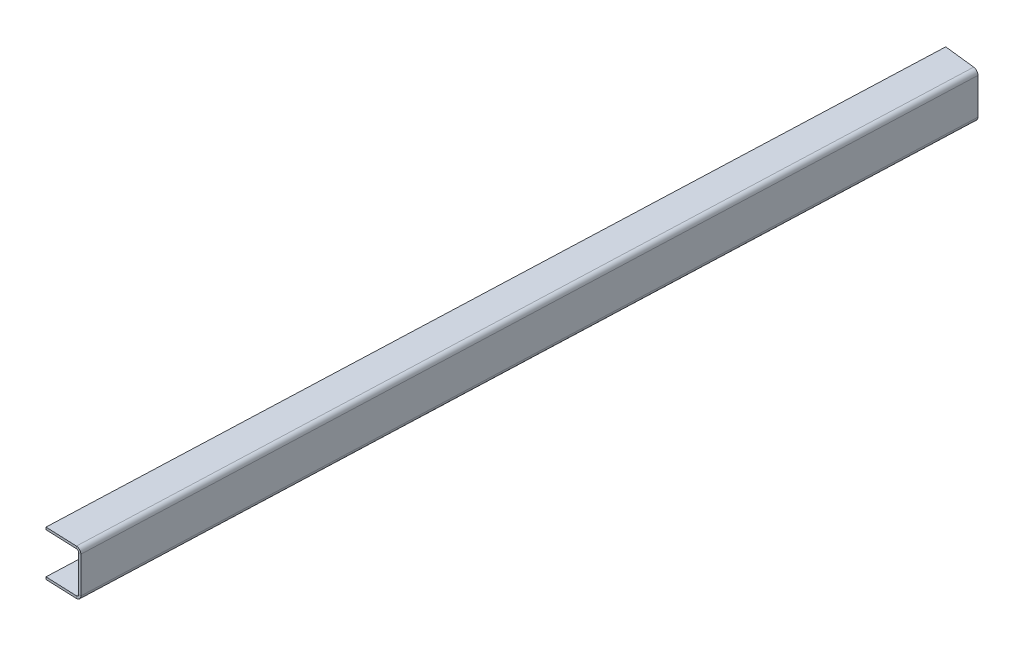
ISO-10303-21;
HEADER;
FILE_DESCRIPTION(('STEP AP214'),'2;1');
FILE_NAME('part.step','',(''),(''),'','','');
FILE_SCHEMA(('AUTOMOTIVE_DESIGN { 1 0 10303 214 1 1 1 1 }'));
ENDSEC;
DATA;
#1=APPLICATION_CONTEXT('core data for automotive mechanical design processes');
#2=APPLICATION_PROTOCOL_DEFINITION('international standard','automotive_design',2000,#1);
#3=PRODUCT_CONTEXT('',#1,'mechanical');
#4=PRODUCT('Part','Part','',(#3));
#5=PRODUCT_RELATED_PRODUCT_CATEGORY('part','',(#4));
#6=PRODUCT_DEFINITION_FORMATION('','',#4);
#7=PRODUCT_DEFINITION_CONTEXT('part definition',#1,'design');
#8=PRODUCT_DEFINITION('design','',#6,#7);
#9=PRODUCT_DEFINITION_SHAPE('','',#8);
#10=(LENGTH_UNIT() NAMED_UNIT(*) SI_UNIT(.MILLI.,.METRE.));
#11=(NAMED_UNIT(*) PLANE_ANGLE_UNIT() SI_UNIT($,.RADIAN.));
#12=(NAMED_UNIT(*) SI_UNIT($,.STERADIAN.) SOLID_ANGLE_UNIT());
#13=UNCERTAINTY_MEASURE_WITH_UNIT(LENGTH_MEASURE(1.E-05),#10,'distance_accuracy_value','');
#14=(GEOMETRIC_REPRESENTATION_CONTEXT(3) GLOBAL_UNCERTAINTY_ASSIGNED_CONTEXT((#13)) GLOBAL_UNIT_ASSIGNED_CONTEXT((#10,
#11,#12)) REPRESENTATION_CONTEXT('',''));
#15=CARTESIAN_POINT('',(0.,0.,0.));
#16=DIRECTION('',(0.,0.,1.));
#17=DIRECTION('',(1.,0.,0.));
#18=AXIS2_PLACEMENT_3D('',#15,#16,#17);
#19=CARTESIAN_POINT('',(-1860.75984555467,0.,-735.315502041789));
#20=DIRECTION('',(0.0392134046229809,0.,-0.999230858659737));
#21=DIRECTION('',(0.,1.,0.));
#22=AXIS2_PLACEMENT_3D('',#19,#20,#21);
#23=PLANE('',#22);
#24=DIRECTION('',(-0.999230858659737,0.,-0.0392134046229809));
#25=VECTOR('',#24,1.);
#26=CARTESIAN_POINT('',(-1860.75984555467,-28.4988000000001,-735.315502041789));
#27=LINE('',#26,#25);
#28=CARTESIAN_POINT('',(-1859.13549587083,-28.4988000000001,-735.251756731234));
#29=VERTEX_POINT('',#28);
#30=CARTESIAN_POINT('',(-1860.75984555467,-28.4988000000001,-735.315502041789));
#31=VERTEX_POINT('',#30);
#32=EDGE_CURVE('E12',#29,#31,#27,.T.);
#33=ORIENTED_EDGE('',*,*,#32,.F.);
#34=DIRECTION('',(0.,1.,0.));
#35=VECTOR('',#34,1.);
#36=CARTESIAN_POINT('',(-1859.13549587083,0.,-735.251756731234));
#37=LINE('',#36,#35);
#38=CARTESIAN_POINT('',(-1859.13549587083,-3.25120000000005,-735.251756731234));
#39=VERTEX_POINT('',#38);
#40=EDGE_CURVE('E137',#29,#39,#37,.T.);
#41=ORIENTED_EDGE('',*,*,#40,.T.);
#42=DIRECTION('',(-0.99923085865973,0.,-0.0392134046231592));
#43=VECTOR('',#42,1.);
#44=CARTESIAN_POINT('',(-1860.75984555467,-3.25120000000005,-735.315502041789));
#45=LINE('',#44,#43);
#46=CARTESIAN_POINT('',(-1860.75984555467,-3.25120000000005,-735.315502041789));
#47=VERTEX_POINT('',#46);
#48=EDGE_CURVE('E90',#39,#47,#45,.T.);
#49=ORIENTED_EDGE('',*,*,#48,.T.);
#50=DIRECTION('',(0.,1.,0.));
#51=VECTOR('',#50,1.);
#52=CARTESIAN_POINT('',(-1860.75984555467,0.,-735.315502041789));
#53=LINE('',#52,#51);
#54=EDGE_CURVE('E139',#31,#47,#53,.T.);
#55=ORIENTED_EDGE('',*,*,#54,.F.);
#56=EDGE_LOOP('',(#33,#41,#49,#55));
#57=FACE_BOUND('',#56,.T.);
#58=ADVANCED_FACE('F78',(#57),#23,.F.);
#59=CARTESIAN_POINT('',(-1864.00847379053,-3.25120000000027,-735.444805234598));
#60=CARTESIAN_POINT('',(-1864.54992368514,-3.25120000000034,-735.466053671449));
#61=CARTESIAN_POINT('',(-1865.09137357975,-3.25120000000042,-735.487302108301));
#62=CARTESIAN_POINT('',(-1865.63282347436,-3.25120000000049,-735.508550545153));
#63=CARTESIAN_POINT('',(-1864.00847379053,-6.50240000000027,-735.444805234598));
#64=CARTESIAN_POINT('',(-1864.54992368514,-7.58613333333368,-735.466053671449));
#65=CARTESIAN_POINT('',(-1865.09137357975,-8.66986666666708,-735.487302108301));
#66=CARTESIAN_POINT('',(-1865.63282347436,-9.75360000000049,-735.508550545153));
#67=CARTESIAN_POINT('',(-1860.75984555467,-6.50239999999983,-735.315502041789));
#68=CARTESIAN_POINT('',(-1860.21839566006,-7.58613333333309,-735.294253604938));
#69=CARTESIAN_POINT('',(-1859.67694576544,-8.66986666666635,-735.273005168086));
#70=CARTESIAN_POINT('',(-1859.13549587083,-9.75359999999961,-735.251756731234));
#71=CARTESIAN_POINT('',(-1860.75984555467,-3.25119999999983,-735.315502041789));
#72=CARTESIAN_POINT('',(-1860.21839566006,-3.25119999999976,-735.294253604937));
#73=CARTESIAN_POINT('',(-1859.67694576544,-3.25119999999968,-735.273005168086));
#74=CARTESIAN_POINT('',(-1859.13549587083,-3.25119999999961,-735.251756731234));
#75=CARTESIAN_POINT('',(-1860.75984555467,1.69569219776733E-13,-735.315502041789));
#76=CARTESIAN_POINT('',(-1860.21839566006,1.08373333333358,-735.294253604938));
#77=CARTESIAN_POINT('',(-1859.67694576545,2.16746666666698,-735.273005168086));
#78=CARTESIAN_POINT('',(-1859.13549587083,3.25120000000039,-735.251756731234));
#79=CARTESIAN_POINT('',(-1864.00847379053,-2.70183181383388E-13,-735.444805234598));
#80=CARTESIAN_POINT('',(-1864.54992368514,1.08373333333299,-735.466053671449));
#81=CARTESIAN_POINT('',(-1865.09137357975,2.16746666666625,-735.487302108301));
#82=CARTESIAN_POINT('',(-1865.63282347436,3.25119999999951,-735.508550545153));
#83=CARTESIAN_POINT('',(-1864.00847379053,-3.25120000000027,-735.444805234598));
#84=CARTESIAN_POINT('',(-1864.54992368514,-3.25120000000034,-735.466053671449));
#85=CARTESIAN_POINT('',(-1865.09137357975,-3.25120000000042,-735.487302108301));
#86=CARTESIAN_POINT('',(-1865.63282347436,-3.25120000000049,-735.508550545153));
#87=(BOUNDED_SURFACE() B_SPLINE_SURFACE(3,3,((#59,#60,#61,#62),(#63,#64,#65,#66),(#67,#68,#69,
#70),(#71,#72,#73,#74),(#75,#76,#77,#78),(#79,#80,#81,#82),(#83,#84,#85,#86)),.UNSPECIFIED.,.T.,
.F.,.F.) B_SPLINE_SURFACE_WITH_KNOTS((4,3,4),(4,4),(0.,0.5,1.),(0.,1.),
.UNSPECIFIED.) GEOMETRIC_REPRESENTATION_ITEM() RATIONAL_B_SPLINE_SURFACE(((1.,1.,1.,1.),
(0.333333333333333,0.333333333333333,0.333333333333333,0.333333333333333),(0.333333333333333,
0.333333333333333,0.333333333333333,0.333333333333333),(1.,1.,1.,1.),(0.333333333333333,
0.333333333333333,0.333333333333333,0.333333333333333),(0.333333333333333,0.333333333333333,
0.333333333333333,0.333333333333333),(1.,1.,1.,1.))) REPRESENTATION_ITEM('') SURFACE());
#88=CARTESIAN_POINT('',(-1862.3841596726,-3.25120000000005,-735.380153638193));
#89=DIRECTION('',(-0.0394921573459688,0.,0.999219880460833));
#90=DIRECTION('',(-0.999219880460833,-1.35258484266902E-13,-0.0394921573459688));
#91=AXIS2_PLACEMENT_3D('',#88,#89,#90);
#92=ELLIPSE('',#91,3.25120012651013,3.2512);
#93=CARTESIAN_POINT('',(-1862.3841596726,0.,-735.380153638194));
#94=VERTEX_POINT('',#93);
#95=EDGE_CURVE('E215',#39,#94,#92,.T.);
#96=DIRECTION('',(0.,-1.,0.));
#97=VECTOR('',#96,1.);
#98=CARTESIAN_POINT('',(-1862.3841596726,-1.62560000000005,-735.380153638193));
#99=LINE('',#98,#97);
#100=CARTESIAN_POINT('',(-1862.3841596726,-1.62560000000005,-735.380153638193));
#101=VERTEX_POINT('',#100);
#102=EDGE_CURVE('E205',#94,#101,#99,.T.);
#103=CARTESIAN_POINT('',(-1862.3841596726,-3.25120000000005,-735.380153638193));
#104=DIRECTION('',(-0.0397709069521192,0.,0.999208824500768));
#105=DIRECTION('',(-0.999208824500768,-1.35321803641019E-13,-0.0397709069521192));
#106=AXIS2_PLACEMENT_3D('',#103,#104,#105);
#107=ELLIPSE('',#106,1.62560025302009,1.6256);
#108=EDGE_CURVE('E213',#47,#101,#107,.T.);
#109=ORIENTED_EDGE('',*,*,#48,.F.);
#110=ORIENTED_EDGE('',*,*,#95,.T.);
#111=ORIENTED_EDGE('',*,*,#102,.T.);
#112=ORIENTED_EDGE('',*,*,#108,.F.);
#113=EDGE_LOOP('',(#109,#110,#111,#112));
#114=FACE_BOUND('',#113,.T.);
#115=ADVANCED_FACE('F212',(#114),#87,.F.);
#116=CARTESIAN_POINT('',(-1884.51983018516,-1.62560000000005,-736.261206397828));
#117=DIRECTION('',(-0.0397709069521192,0.,0.999208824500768));
#118=DIRECTION('',(0.999208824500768,0.,0.0397709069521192));
#119=AXIS2_PLACEMENT_3D('',#116,#117,#118);
#120=PLANE('',#119);
#121=ORIENTED_EDGE('',*,*,#102,.F.);
#122=DIRECTION('',(0.999208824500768,0.,0.0397709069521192));
#123=VECTOR('',#122,1.);
#124=CARTESIAN_POINT('',(-1884.51983018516,0.,-736.261206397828));
#125=LINE('',#124,#123);
#126=CARTESIAN_POINT('',(-1884.51983018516,0.,-736.261206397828));
#127=VERTEX_POINT('',#126);
#128=EDGE_CURVE('E176',#127,#94,#125,.T.);
#129=ORIENTED_EDGE('',*,*,#128,.F.);
#130=DIRECTION('',(0.,-1.,0.));
#131=VECTOR('',#130,1.);
#132=CARTESIAN_POINT('',(-1884.51983018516,-1.62560000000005,-736.261206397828));
#133=LINE('',#132,#131);
#134=CARTESIAN_POINT('',(-1884.51983018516,-1.62560000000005,-736.261206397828));
#135=VERTEX_POINT('',#134);
#136=EDGE_CURVE('E202',#127,#135,#133,.T.);
#137=ORIENTED_EDGE('',*,*,#136,.T.);
#138=DIRECTION('',(0.999208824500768,0.,0.0397709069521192));
#139=VECTOR('',#138,1.);
#140=CARTESIAN_POINT('',(-1884.51983018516,-1.62560000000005,-736.261206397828));
#141=LINE('',#140,#139);
#142=EDGE_CURVE('E232',#135,#101,#141,.T.);
#143=ORIENTED_EDGE('',*,*,#142,.T.);
#144=EDGE_LOOP('',(#121,#129,#137,#143));
#145=FACE_BOUND('',#144,.T.);
#146=ADVANCED_FACE('F233',(#145),#120,.T.);
#147=CARTESIAN_POINT('',(-1860.75870638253,-1.6256000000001,-1341.73906194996));
#148=DIRECTION('',(-0.999230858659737,0.,-0.0392134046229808));
#149=DIRECTION('',(-0.0392134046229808,0.,0.999230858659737));
#150=AXIS2_PLACEMENT_3D('',#147,#148,#149);
#151=PLANE('',#150);
#152=ORIENTED_EDGE('',*,*,#136,.F.);
#153=DIRECTION('',(-0.0392134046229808,0.,0.999230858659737));
#154=VECTOR('',#153,1.);
#155=CARTESIAN_POINT('',(-1860.75870638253,0.,-1341.73906194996));
#156=LINE('',#155,#154);
#157=CARTESIAN_POINT('',(-1860.75870638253,0.,-1341.73906194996));
#158=VERTEX_POINT('',#157);
#159=EDGE_CURVE('E168',#158,#127,#156,.T.);
#160=ORIENTED_EDGE('',*,*,#159,.F.);
#161=DIRECTION('',(0.,-1.,0.));
#162=VECTOR('',#161,1.);
#163=CARTESIAN_POINT('',(-1860.75870638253,-1.6256000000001,-1341.73906194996));
#164=LINE('',#163,#162);
#165=CARTESIAN_POINT('',(-1860.75870638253,-1.6256000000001,-1341.73906194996));
#166=VERTEX_POINT('',#165);
#167=EDGE_CURVE('E199',#158,#166,#164,.T.);
#168=ORIENTED_EDGE('',*,*,#167,.T.);
#169=DIRECTION('',(-0.0392134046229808,0.,0.999230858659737));
#170=VECTOR('',#169,1.);
#171=CARTESIAN_POINT('',(-1860.75870638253,-1.6256000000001,-1341.73906194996));
#172=LINE('',#171,#170);
#173=EDGE_CURVE('E237',#166,#135,#172,.T.);
#174=ORIENTED_EDGE('',*,*,#173,.T.);
#175=EDGE_LOOP('',(#152,#160,#168,#174));
#176=FACE_BOUND('',#175,.T.);
#177=ADVANCED_FACE('F280',(#176),#151,.T.);
#178=CARTESIAN_POINT('',(-1835.45162545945,-1.6256000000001,-1338.87310832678));
#179=DIRECTION('',(0.112527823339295,0.,-0.993648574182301));
#180=DIRECTION('',(-0.993648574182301,0.,-0.112527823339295));
#181=AXIS2_PLACEMENT_3D('',#178,#179,#180);
#182=PLANE('',#181);
#183=ORIENTED_EDGE('',*,*,#167,.F.);
#184=DIRECTION('',(-0.993648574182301,0.,-0.112527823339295));
#185=VECTOR('',#184,1.);
#186=CARTESIAN_POINT('',(-1835.45162545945,0.,-1338.87310832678));
#187=LINE('',#186,#185);
#188=CARTESIAN_POINT('',(-1838.68655376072,0.,-1339.23945458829));
#189=VERTEX_POINT('',#188);
#190=EDGE_CURVE('E173',#189,#158,#187,.T.);
#191=ORIENTED_EDGE('',*,*,#190,.F.);
#192=DIRECTION('',(0.,-1.,-2.73184799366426E-13));
#193=VECTOR('',#192,1.);
#194=CARTESIAN_POINT('',(-1838.68655376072,-1.6256000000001,-1339.23945458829));
#195=LINE('',#194,#193);
#196=CARTESIAN_POINT('',(-1838.68655376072,-1.6256000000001,-1339.23945458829));
#197=VERTEX_POINT('',#196);
#198=EDGE_CURVE('E196',#189,#197,#195,.T.);
#199=ORIENTED_EDGE('',*,*,#198,.T.);
#200=DIRECTION('',(-0.993648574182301,0.,-0.112527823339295));
#201=VECTOR('',#200,1.);
#202=CARTESIAN_POINT('',(-1835.45162545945,-1.6256000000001,-1338.87310832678));
#203=LINE('',#202,#201);
#204=EDGE_CURVE('E238',#197,#166,#203,.T.);
#205=ORIENTED_EDGE('',*,*,#204,.T.);
#206=EDGE_LOOP('',(#183,#191,#199,#205));
#207=FACE_BOUND('',#206,.T.);
#208=ADVANCED_FACE('F307',(#207),#182,.T.);
#209=CARTESIAN_POINT('',(-1840.3062069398,-3.2512000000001,-1339.42287562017));
#210=CARTESIAN_POINT('',(-1840.84765683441,-3.2512000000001,-1339.44412405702));
#211=CARTESIAN_POINT('',(-1841.38910672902,-3.2512000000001,-1339.46537249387));
#212=CARTESIAN_POINT('',(-1841.93055662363,-3.2512000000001,-1339.48662093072));
#213=CARTESIAN_POINT('',(-1840.3062069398,0.,-1339.42287562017));
#214=CARTESIAN_POINT('',(-1840.84765683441,1.08373333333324,-1339.44412405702));
#215=CARTESIAN_POINT('',(-1841.38910672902,2.16746666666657,-1339.46537249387));
#216=CARTESIAN_POINT('',(-1841.93055662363,3.2511999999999,-1339.48662093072));
#217=CARTESIAN_POINT('',(-1837.06690058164,0.,-1339.0560335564));
#218=CARTESIAN_POINT('',(-1836.52545068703,1.08373333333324,-1339.03478511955));
#219=CARTESIAN_POINT('',(-1835.98400079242,2.16746666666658,-1339.0135366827));
#220=CARTESIAN_POINT('',(-1835.4425508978,3.25119999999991,-1338.99228824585));
#221=CARTESIAN_POINT('',(-1837.06690058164,-3.25120000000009,-1339.0560335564));
#222=CARTESIAN_POINT('',(-1836.52545068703,-3.25120000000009,-1339.03478511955));
#223=CARTESIAN_POINT('',(-1835.98400079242,-3.25120000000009,-1339.0135366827));
#224=CARTESIAN_POINT('',(-1835.4425508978,-3.25120000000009,-1338.99228824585));
#225=CARTESIAN_POINT('',(-1837.06690058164,-6.50240000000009,-1339.0560335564));
#226=CARTESIAN_POINT('',(-1836.52545068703,-7.58613333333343,-1339.03478511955));
#227=CARTESIAN_POINT('',(-1835.98400079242,-8.66986666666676,-1339.0135366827));
#228=CARTESIAN_POINT('',(-1835.4425508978,-9.75360000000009,-1338.99228824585));
#229=CARTESIAN_POINT('',(-1840.3062069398,-6.5024000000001,-1339.42287562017));
#230=CARTESIAN_POINT('',(-1840.84765683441,-7.58613333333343,-1339.44412405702));
#231=CARTESIAN_POINT('',(-1841.38910672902,-8.66986666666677,-1339.46537249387));
#232=CARTESIAN_POINT('',(-1841.93055662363,-9.7536000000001,-1339.48662093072));
#233=CARTESIAN_POINT('',(-1840.3062069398,-3.2512000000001,-1339.42287562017));
#234=CARTESIAN_POINT('',(-1840.84765683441,-3.2512000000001,-1339.44412405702));
#235=CARTESIAN_POINT('',(-1841.38910672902,-3.2512000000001,-1339.46537249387));
#236=CARTESIAN_POINT('',(-1841.93055662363,-3.2512000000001,-1339.48662093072));
#237=(BOUNDED_SURFACE() B_SPLINE_SURFACE(3,3,((#209,#210,#211,#212),(#213,#214,#215,#216),(#217,
#218,#219,#220),(#221,#222,#223,#224),(#225,#226,#227,#228),(#229,#230,#231,#232),(#233,#234,
#235,#236)),.UNSPECIFIED.,.T.,.F.,.F.) B_SPLINE_SURFACE_WITH_KNOTS((4,3,4),(4,4),(0.,0.5,1.),
(0.,1.),.UNSPECIFIED.) GEOMETRIC_REPRESENTATION_ITEM() RATIONAL_B_SPLINE_SURFACE(((1.,1.,1.,1.),
(0.333333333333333,0.333333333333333,0.333333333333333,0.333333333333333),(0.333333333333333,
0.333333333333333,0.333333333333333,0.333333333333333),(1.,1.,1.,1.),(0.333333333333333,
0.333333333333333,0.333333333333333,0.333333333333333),(0.333333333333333,0.333333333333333,
0.333333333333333,0.333333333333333),(1.,1.,1.,1.))) REPRESENTATION_ITEM('') SURFACE());
#238=CARTESIAN_POINT('',(-1838.68655376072,-3.25120000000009,-1339.23945458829));
#239=DIRECTION('',(0.0759715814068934,0.,-0.997109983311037));
#240=DIRECTION('',(-0.997109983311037,0.,-0.0759715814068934));
#241=AXIS2_PLACEMENT_3D('',#238,#239,#240);
#242=ELLIPSE('',#241,3.25340525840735,3.2512);
#243=CARTESIAN_POINT('',(-1835.4425508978,-3.25120000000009,-1338.99228824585));
#244=VERTEX_POINT('',#243);
#245=EDGE_CURVE('E178',#189,#244,#242,.T.);
#246=DIRECTION('',(-0.999230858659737,0.,-0.0392134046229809));
#247=VECTOR('',#246,1.);
#248=CARTESIAN_POINT('',(-1837.06690058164,-3.25120000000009,-1339.0560335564));
#249=LINE('',#248,#247);
#250=CARTESIAN_POINT('',(-1837.06690058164,-3.25120000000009,-1339.0560335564));
#251=VERTEX_POINT('',#250);
#252=EDGE_CURVE('E194',#244,#251,#249,.T.);
#253=CARTESIAN_POINT('',(-1838.68655376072,-3.25120000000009,-1339.23945458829));
#254=DIRECTION('',(0.112527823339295,0.,-0.993648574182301));
#255=DIRECTION('',(-0.993648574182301,0.,-0.112527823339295));
#256=AXIS2_PLACEMENT_3D('',#253,#254,#255);
#257=ELLIPSE('',#256,1.6300060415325,1.6256);
#258=EDGE_CURVE('E229',#197,#251,#257,.T.);
#259=ORIENTED_EDGE('',*,*,#198,.F.);
#260=ORIENTED_EDGE('',*,*,#245,.T.);
#261=ORIENTED_EDGE('',*,*,#252,.T.);
#262=ORIENTED_EDGE('',*,*,#258,.F.);
#263=EDGE_LOOP('',(#259,#260,#261,#262));
#264=FACE_BOUND('',#263,.T.);
#265=ADVANCED_FACE('F357',(#264),#237,.F.);
#266=CARTESIAN_POINT('',(-1837.06690058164,0.,-1339.0560335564));
#267=DIRECTION('',(-0.0392134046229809,0.,0.999230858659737));
#268=DIRECTION('',(0.,-1.,0.));
#269=AXIS2_PLACEMENT_3D('',#266,#267,#268);
#270=PLANE('',#269);
#271=ORIENTED_EDGE('',*,*,#252,.F.);
#272=DIRECTION('',(0.,1.,0.));
#273=VECTOR('',#272,1.);
#274=CARTESIAN_POINT('',(-1835.4425508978,0.,-1338.99228824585));
#275=LINE('',#274,#273);
#276=CARTESIAN_POINT('',(-1835.4425508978,-28.4988000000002,-1338.99228824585));
#277=VERTEX_POINT('',#276);
#278=EDGE_CURVE('E167',#244,#277,#275,.F.);
#279=ORIENTED_EDGE('',*,*,#278,.T.);
#280=DIRECTION('',(-0.99923085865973,0.,-0.0392134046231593));
#281=VECTOR('',#280,1.);
#282=CARTESIAN_POINT('',(-1837.06690058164,-28.4988000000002,-1339.0560335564));
#283=LINE('',#282,#281);
#284=CARTESIAN_POINT('',(-1837.06690058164,-28.4988000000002,-1339.0560335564));
#285=VERTEX_POINT('',#284);
#286=EDGE_CURVE('E191',#277,#285,#283,.T.);
#287=ORIENTED_EDGE('',*,*,#286,.T.);
#288=DIRECTION('',(0.,-1.,0.));
#289=VECTOR('',#288,1.);
#290=CARTESIAN_POINT('',(-1837.06690058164,0.,-1339.0560335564));
#291=LINE('',#290,#289);
#292=EDGE_CURVE('E284',#251,#285,#291,.T.);
#293=ORIENTED_EDGE('',*,*,#292,.F.);
#294=EDGE_LOOP('',(#271,#279,#287,#293));
#295=FACE_BOUND('',#294,.T.);
#296=ADVANCED_FACE('F322',(#295),#270,.F.);
#297=CARTESIAN_POINT('',(-1837.06690058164,-28.4988000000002,-1339.0560335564));
#298=CARTESIAN_POINT('',(-1836.52545068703,-28.4988000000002,-1339.03478511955));
#299=CARTESIAN_POINT('',(-1835.98400079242,-28.4988000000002,-1339.0135366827));
#300=CARTESIAN_POINT('',(-1835.4425508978,-28.4988000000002,-1338.99228824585));
#301=CARTESIAN_POINT('',(-1837.06690058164,-31.7500000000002,-1339.0560335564));
#302=CARTESIAN_POINT('',(-1836.52545068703,-32.8337333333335,-1339.03478511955));
#303=CARTESIAN_POINT('',(-1835.98400079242,-33.9174666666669,-1339.0135366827));
#304=CARTESIAN_POINT('',(-1835.4425508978,-35.0012000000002,-1338.99228824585));
#305=CARTESIAN_POINT('',(-1840.3062069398,-31.7500000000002,-1339.42287562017));
#306=CARTESIAN_POINT('',(-1840.84765683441,-32.8337333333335,-1339.44412405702));
#307=CARTESIAN_POINT('',(-1841.38910672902,-33.9174666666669,-1339.46537249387));
#308=CARTESIAN_POINT('',(-1841.93055662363,-35.0012000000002,-1339.48662093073));
#309=CARTESIAN_POINT('',(-1840.3062069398,-28.4988000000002,-1339.42287562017));
#310=CARTESIAN_POINT('',(-1840.84765683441,-28.4988000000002,-1339.44412405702));
#311=CARTESIAN_POINT('',(-1841.38910672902,-28.4988000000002,-1339.46537249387));
#312=CARTESIAN_POINT('',(-1841.93055662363,-28.4988000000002,-1339.48662093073));
#313=CARTESIAN_POINT('',(-1840.3062069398,-25.2476000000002,-1339.42287562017));
#314=CARTESIAN_POINT('',(-1840.84765683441,-24.1638666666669,-1339.44412405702));
#315=CARTESIAN_POINT('',(-1841.38910672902,-23.0801333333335,-1339.46537249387));
#316=CARTESIAN_POINT('',(-1841.93055662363,-21.9964000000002,-1339.48662093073));
#317=CARTESIAN_POINT('',(-1837.06690058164,-25.2476000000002,-1339.0560335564));
#318=CARTESIAN_POINT('',(-1836.52545068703,-24.1638666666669,-1339.03478511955));
#319=CARTESIAN_POINT('',(-1835.98400079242,-23.0801333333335,-1339.0135366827));
#320=CARTESIAN_POINT('',(-1835.4425508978,-21.9964000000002,-1338.99228824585));
#321=CARTESIAN_POINT('',(-1837.06690058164,-28.4988000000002,-1339.0560335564));
#322=CARTESIAN_POINT('',(-1836.52545068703,-28.4988000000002,-1339.03478511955));
#323=CARTESIAN_POINT('',(-1835.98400079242,-28.4988000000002,-1339.0135366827));
#324=CARTESIAN_POINT('',(-1835.4425508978,-28.4988000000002,-1338.99228824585));
#325=(BOUNDED_SURFACE() B_SPLINE_SURFACE(3,3,((#297,#298,#299,#300),(#301,#302,#303,#304),(#305,
#306,#307,#308),(#309,#310,#311,#312),(#313,#314,#315,#316),(#317,#318,#319,#320),(#321,#322,
#323,#324)),.UNSPECIFIED.,.T.,.F.,.F.) B_SPLINE_SURFACE_WITH_KNOTS((4,3,4),(4,4),(0.,0.5,1.),
(0.,1.),.UNSPECIFIED.) GEOMETRIC_REPRESENTATION_ITEM() RATIONAL_B_SPLINE_SURFACE(((1.,1.,1.,1.),
(0.333333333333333,0.333333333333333,0.333333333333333,0.333333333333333),(0.333333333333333,
0.333333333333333,0.333333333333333,0.333333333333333),(1.,1.,1.,1.),(0.333333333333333,
0.333333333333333,0.333333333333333,0.333333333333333),(0.333333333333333,0.333333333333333,
0.333333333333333,0.333333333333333),(1.,1.,1.,1.))) REPRESENTATION_ITEM('') SURFACE());
#326=CARTESIAN_POINT('',(-1838.68655376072,-28.4988000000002,-1339.23945458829));
#327=DIRECTION('',(0.0759715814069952,0.,-0.997109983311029));
#328=DIRECTION('',(0.997109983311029,0.,0.0759715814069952));
#329=AXIS2_PLACEMENT_3D('',#326,#327,#328);
#330=ELLIPSE('',#329,3.25340525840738,3.2512);
#331=CARTESIAN_POINT('',(-1838.68655376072,-31.7500000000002,-1339.23945458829));
#332=VERTEX_POINT('',#331);
#333=EDGE_CURVE('E155',#277,#332,#330,.T.);
#334=DIRECTION('',(0.,1.,0.));
#335=VECTOR('',#334,1.);
#336=CARTESIAN_POINT('',(-1838.68655376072,-30.1244000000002,-1339.23945458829));
#337=LINE('',#336,#335);
#338=CARTESIAN_POINT('',(-1838.68655376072,-30.1244000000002,-1339.23945458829));
#339=VERTEX_POINT('',#338);
#340=EDGE_CURVE('E188',#332,#339,#337,.T.);
#341=CARTESIAN_POINT('',(-1838.68655376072,-28.4988000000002,-1339.23945458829));
#342=DIRECTION('',(0.112527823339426,0.,-0.993648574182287));
#343=DIRECTION('',(0.993648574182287,0.,0.112527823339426));
#344=AXIS2_PLACEMENT_3D('',#341,#342,#343);
#345=ELLIPSE('',#344,1.63000604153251,1.6256);
#346=EDGE_CURVE('E254',#285,#339,#345,.T.);
#347=ORIENTED_EDGE('',*,*,#286,.F.);
#348=ORIENTED_EDGE('',*,*,#333,.T.);
#349=ORIENTED_EDGE('',*,*,#340,.T.);
#350=ORIENTED_EDGE('',*,*,#346,.F.);
#351=EDGE_LOOP('',(#347,#348,#349,#350));
#352=FACE_BOUND('',#351,.T.);
#353=ADVANCED_FACE('F326',(#352),#325,.F.);
#354=CARTESIAN_POINT('',(-1860.75870638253,-30.1244000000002,-1341.73906194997));
#355=DIRECTION('',(0.112527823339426,0.,-0.993648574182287));
#356=DIRECTION('',(0.993648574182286,0.,0.112527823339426));
#357=AXIS2_PLACEMENT_3D('',#354,#355,#356);
#358=PLANE('',#357);
#359=ORIENTED_EDGE('',*,*,#340,.F.);
#360=DIRECTION('',(0.993648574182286,0.,0.112527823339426));
#361=VECTOR('',#360,1.);
#362=CARTESIAN_POINT('',(-1860.75870638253,-31.7500000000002,-1341.73906194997));
#363=LINE('',#362,#361);
#364=CARTESIAN_POINT('',(-1860.75870638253,-31.7500000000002,-1341.73906194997));
#365=VERTEX_POINT('',#364);
#366=EDGE_CURVE('E262',#365,#332,#363,.T.);
#367=ORIENTED_EDGE('',*,*,#366,.F.);
#368=DIRECTION('',(0.,1.,0.));
#369=VECTOR('',#368,1.);
#370=CARTESIAN_POINT('',(-1860.75870638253,-30.1244000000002,-1341.73906194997));
#371=LINE('',#370,#369);
#372=CARTESIAN_POINT('',(-1860.75870638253,-30.1244000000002,-1341.73906194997));
#373=VERTEX_POINT('',#372);
#374=EDGE_CURVE('E185',#365,#373,#371,.T.);
#375=ORIENTED_EDGE('',*,*,#374,.T.);
#376=DIRECTION('',(0.993648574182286,0.,0.112527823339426));
#377=VECTOR('',#376,1.);
#378=CARTESIAN_POINT('',(-1860.75870638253,-30.1244000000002,-1341.73906194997));
#379=LINE('',#378,#377);
#380=EDGE_CURVE('E293',#373,#339,#379,.T.);
#381=ORIENTED_EDGE('',*,*,#380,.T.);
#382=EDGE_LOOP('',(#359,#367,#375,#381));
#383=FACE_BOUND('',#382,.T.);
#384=ADVANCED_FACE('F374',(#383),#358,.T.);
#385=CARTESIAN_POINT('',(-1884.51983018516,-30.1244000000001,-736.26120639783));
#386=DIRECTION('',(-0.999230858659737,0.,-0.0392134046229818));
#387=DIRECTION('',(0.0392134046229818,0.,-0.999230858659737));
#388=AXIS2_PLACEMENT_3D('',#385,#386,#387);
#389=PLANE('',#388);
#390=ORIENTED_EDGE('',*,*,#374,.F.);
#391=DIRECTION('',(0.0392134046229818,0.,-0.999230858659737));
#392=VECTOR('',#391,1.);
#393=CARTESIAN_POINT('',(-1884.51983018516,-31.7500000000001,-736.26120639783));
#394=LINE('',#393,#392);
#395=CARTESIAN_POINT('',(-1884.51983018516,-31.7500000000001,-736.26120639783));
#396=VERTEX_POINT('',#395);
#397=EDGE_CURVE('E255',#396,#365,#394,.T.);
#398=ORIENTED_EDGE('',*,*,#397,.F.);
#399=DIRECTION('',(0.,1.,0.));
#400=VECTOR('',#399,1.);
#401=CARTESIAN_POINT('',(-1884.51983018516,-30.1244000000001,-736.26120639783));
#402=LINE('',#401,#400);
#403=CARTESIAN_POINT('',(-1884.51983018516,-30.1244000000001,-736.26120639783));
#404=VERTEX_POINT('',#403);
#405=EDGE_CURVE('E182',#396,#404,#402,.T.);
#406=ORIENTED_EDGE('',*,*,#405,.T.);
#407=DIRECTION('',(0.0392134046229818,0.,-0.999230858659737));
#408=VECTOR('',#407,1.);
#409=CARTESIAN_POINT('',(-1884.51983018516,-30.1244000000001,-736.26120639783));
#410=LINE('',#409,#408);
#411=EDGE_CURVE('E296',#404,#373,#410,.T.);
#412=ORIENTED_EDGE('',*,*,#411,.T.);
#413=EDGE_LOOP('',(#390,#398,#406,#412));
#414=FACE_BOUND('',#413,.T.);
#415=ADVANCED_FACE('F382',(#414),#389,.T.);
#416=CARTESIAN_POINT('',(-1859.13992209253,-30.1244000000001,-735.251025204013));
#417=DIRECTION('',(-0.0397709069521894,0.,0.999208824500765));
#418=DIRECTION('',(-0.999208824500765,0.,-0.0397709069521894));
#419=AXIS2_PLACEMENT_3D('',#416,#417,#418);
#420=PLANE('',#419);
#421=ORIENTED_EDGE('',*,*,#405,.F.);
#422=DIRECTION('',(-0.999208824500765,0.,-0.0397709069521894));
#423=VECTOR('',#422,1.);
#424=CARTESIAN_POINT('',(-1859.13992209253,-31.7500000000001,-735.251025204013));
#425=LINE('',#424,#423);
#426=CARTESIAN_POINT('',(-1862.3841596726,-31.7500000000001,-735.380153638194));
#427=VERTEX_POINT('',#426);
#428=EDGE_CURVE('E259',#427,#396,#425,.T.);
#429=ORIENTED_EDGE('',*,*,#428,.F.);
#430=DIRECTION('',(0.,1.,0.));
#431=VECTOR('',#430,1.);
#432=CARTESIAN_POINT('',(-1862.3841596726,-30.1244000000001,-735.380153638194));
#433=LINE('',#432,#431);
#434=CARTESIAN_POINT('',(-1862.3841596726,-30.1244000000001,-735.380153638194));
#435=VERTEX_POINT('',#434);
#436=EDGE_CURVE('E84',#427,#435,#433,.T.);
#437=ORIENTED_EDGE('',*,*,#436,.T.);
#438=DIRECTION('',(-0.999208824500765,0.,-0.0397709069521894));
#439=VECTOR('',#438,1.);
#440=CARTESIAN_POINT('',(-1859.13992209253,-30.1244000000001,-735.251025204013));
#441=LINE('',#440,#439);
#442=EDGE_CURVE('E290',#435,#404,#441,.T.);
#443=ORIENTED_EDGE('',*,*,#442,.T.);
#444=EDGE_LOOP('',(#421,#429,#437,#443));
#445=FACE_BOUND('',#444,.T.);
#446=ADVANCED_FACE('F386',(#445),#420,.T.);
#447=CARTESIAN_POINT('',(-1860.75984555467,-28.4987999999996,-735.315502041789));
#448=CARTESIAN_POINT('',(-1860.21839566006,-28.4987999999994,-735.294253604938));
#449=CARTESIAN_POINT('',(-1859.67694576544,-28.4987999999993,-735.273005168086));
#450=CARTESIAN_POINT('',(-1859.13549587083,-28.4987999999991,-735.251756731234));
#451=CARTESIAN_POINT('',(-1860.75984555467,-25.2475999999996,-735.315502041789));
#452=CARTESIAN_POINT('',(-1860.21839566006,-24.1638666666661,-735.294253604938));
#453=CARTESIAN_POINT('',(-1859.67694576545,-23.0801333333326,-735.273005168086));
#454=CARTESIAN_POINT('',(-1859.13549587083,-21.9963999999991,-735.251756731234));
#455=CARTESIAN_POINT('',(-1864.00847379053,-25.2476000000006,-735.444805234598));
#456=CARTESIAN_POINT('',(-1864.54992368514,-24.1638666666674,-735.46605367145));
#457=CARTESIAN_POINT('',(-1865.09137357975,-23.0801333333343,-735.487302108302));
#458=CARTESIAN_POINT('',(-1865.63282347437,-21.9964000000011,-735.508550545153));
#459=CARTESIAN_POINT('',(-1864.00847379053,-28.4988000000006,-735.444805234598));
#460=CARTESIAN_POINT('',(-1864.54992368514,-28.4988000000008,-735.46605367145));
#461=CARTESIAN_POINT('',(-1865.09137357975,-28.4988000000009,-735.487302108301));
#462=CARTESIAN_POINT('',(-1865.63282347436,-28.4988000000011,-735.508550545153));
#463=CARTESIAN_POINT('',(-1864.00847379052,-31.7500000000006,-735.444805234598));
#464=CARTESIAN_POINT('',(-1864.54992368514,-32.8337333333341,-735.46605367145));
#465=CARTESIAN_POINT('',(-1865.09137357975,-33.9174666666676,-735.487302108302));
#466=CARTESIAN_POINT('',(-1865.63282347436,-35.0012000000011,-735.508550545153));
#467=CARTESIAN_POINT('',(-1860.75984555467,-31.7499999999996,-735.315502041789));
#468=CARTESIAN_POINT('',(-1860.21839566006,-32.8337333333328,-735.294253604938));
#469=CARTESIAN_POINT('',(-1859.67694576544,-33.9174666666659,-735.273005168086));
#470=CARTESIAN_POINT('',(-1859.13549587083,-35.0011999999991,-735.251756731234));
#471=CARTESIAN_POINT('',(-1860.75984555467,-28.4987999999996,-735.315502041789));
#472=CARTESIAN_POINT('',(-1860.21839566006,-28.4987999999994,-735.294253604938));
#473=CARTESIAN_POINT('',(-1859.67694576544,-28.4987999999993,-735.273005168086));
#474=CARTESIAN_POINT('',(-1859.13549587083,-28.4987999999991,-735.251756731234));
#475=(BOUNDED_SURFACE() B_SPLINE_SURFACE(3,3,((#447,#448,#449,#450),(#451,#452,#453,#454),(#455,
#456,#457,#458),(#459,#460,#461,#462),(#463,#464,#465,#466),(#467,#468,#469,#470),(#471,#472,
#473,#474)),.UNSPECIFIED.,.T.,.F.,.F.) B_SPLINE_SURFACE_WITH_KNOTS((4,3,4),(4,4),(0.,0.5,1.),
(0.,1.),.UNSPECIFIED.) GEOMETRIC_REPRESENTATION_ITEM() RATIONAL_B_SPLINE_SURFACE(((1.,1.,1.,1.),
(0.333333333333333,0.333333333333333,0.333333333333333,0.333333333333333),(0.333333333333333,
0.333333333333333,0.333333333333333,0.333333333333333),(1.,1.,1.,1.),(0.333333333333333,
0.333333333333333,0.333333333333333,0.333333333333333),(0.333333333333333,0.333333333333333,
0.333333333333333,0.333333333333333),(1.,1.,1.,1.))) REPRESENTATION_ITEM('') SURFACE());
#476=CARTESIAN_POINT('',(-1862.3841596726,-28.4988000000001,-735.380153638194));
#477=DIRECTION('',(-0.0394921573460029,0.,0.999219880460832));
#478=DIRECTION('',(0.999219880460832,3.09467143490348E-13,0.0394921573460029));
#479=AXIS2_PLACEMENT_3D('',#476,#477,#478);
#480=ELLIPSE('',#479,3.25120012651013,3.2512);
#481=EDGE_CURVE('E152',#427,#29,#480,.T.);
#482=CARTESIAN_POINT('',(-1862.3841596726,-28.4988000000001,-735.380153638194));
#483=DIRECTION('',(-0.0397709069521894,0.,0.999208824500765));
#484=DIRECTION('',(0.999208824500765,3.0881374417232E-13,0.0397709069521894));
#485=AXIS2_PLACEMENT_3D('',#482,#483,#484);
#486=ELLIPSE('',#485,1.62560025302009,1.6256);
#487=EDGE_CURVE('E250',#435,#31,#486,.T.);
#488=ORIENTED_EDGE('',*,*,#481,.T.);
#489=ORIENTED_EDGE('',*,*,#32,.T.);
#490=ORIENTED_EDGE('',*,*,#487,.F.);
#491=ORIENTED_EDGE('',*,*,#436,.F.);
#492=EDGE_LOOP('',(#488,#489,#490,#491));
#493=FACE_BOUND('',#492,.T.);
#494=ADVANCED_FACE('F80',(#493),#475,.F.);
#495=CARTESIAN_POINT('',(0.,-30.1244,0.));
#496=DIRECTION('',(0.,-1.,0.));
#497=DIRECTION('',(0.,0.,-1.));
#498=AXIS2_PLACEMENT_3D('',#495,#496,#497);
#499=PLANE('',#498);
#500=ORIENTED_EDGE('',*,*,#442,.F.);
#501=DIRECTION('',(0.0392134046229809,0.,-0.999230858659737));
#502=VECTOR('',#501,1.);
#503=CARTESIAN_POINT('',(-1838.69125026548,-30.1244000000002,-1339.11977886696));
#504=LINE('',#503,#502);
#505=EDGE_CURVE('E247',#435,#339,#504,.T.);
#506=ORIENTED_EDGE('',*,*,#505,.T.);
#507=ORIENTED_EDGE('',*,*,#380,.F.);
#508=ORIENTED_EDGE('',*,*,#411,.F.);
#509=EDGE_LOOP('',(#500,#506,#507,#508));
#510=FACE_BOUND('',#509,.T.);
#511=ADVANCED_FACE('F411',(#510),#499,.F.);
#512=CARTESIAN_POINT('',(-1886.70827650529,0.,-74.1009712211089));
#513=DIRECTION('',(0.999230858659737,0.,0.0392134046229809));
#514=DIRECTION('',(0.0392134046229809,0.,-0.999230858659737));
#515=AXIS2_PLACEMENT_3D('',#512,#513,#514);
#516=PLANE('',#515);
#517=ORIENTED_EDGE('',*,*,#54,.T.);
#518=DIRECTION('',(-0.0392134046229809,0.,0.999230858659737));
#519=VECTOR('',#518,1.);
#520=CARTESIAN_POINT('',(-1837.06690058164,-3.25120000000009,-1339.0560335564));
#521=LINE('',#520,#519);
#522=EDGE_CURVE('E228',#47,#251,#521,.F.);
#523=ORIENTED_EDGE('',*,*,#522,.T.);
#524=ORIENTED_EDGE('',*,*,#292,.T.);
#525=DIRECTION('',(0.0392134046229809,0.,-0.999230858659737));
#526=VECTOR('',#525,1.);
#527=CARTESIAN_POINT('',(-1860.75984555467,-28.4988000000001,-735.315502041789));
#528=LINE('',#527,#526);
#529=EDGE_CURVE('E244',#285,#31,#528,.F.);
#530=ORIENTED_EDGE('',*,*,#529,.T.);
#531=EDGE_LOOP('',(#517,#523,#524,#530));
#532=FACE_BOUND('',#531,.T.);
#533=ADVANCED_FACE('F325',(#532),#516,.F.);
#534=CARTESIAN_POINT('',(0.,-1.6256,0.));
#535=DIRECTION('',(0.,1.,0.));
#536=DIRECTION('',(0.,0.,1.));
#537=AXIS2_PLACEMENT_3D('',#534,#535,#536);
#538=PLANE('',#537);
#539=ORIENTED_EDGE('',*,*,#204,.F.);
#540=DIRECTION('',(-0.0392134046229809,0.,0.999230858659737));
#541=VECTOR('',#540,1.);
#542=CARTESIAN_POINT('',(-1862.38419523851,-1.62560000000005,-735.379247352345));
#543=LINE('',#542,#541);
#544=EDGE_CURVE('E226',#197,#101,#543,.T.);
#545=ORIENTED_EDGE('',*,*,#544,.T.);
#546=ORIENTED_EDGE('',*,*,#142,.F.);
#547=ORIENTED_EDGE('',*,*,#173,.F.);
#548=EDGE_LOOP('',(#539,#545,#546,#547));
#549=FACE_BOUND('',#548,.T.);
#550=ADVANCED_FACE('F241',(#549),#538,.F.);
#551=CARTESIAN_POINT('',(-1888.33496809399,-28.4988,-74.1050404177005));
#552=DIRECTION('',(-0.0392134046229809,0.,0.999230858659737));
#553=DIRECTION('',(0.999230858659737,0.,0.0392134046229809));
#554=AXIS2_PLACEMENT_3D('',#551,#552,#553);
#555=CYLINDRICAL_SURFACE('',#554,1.6256);
#556=ORIENTED_EDGE('',*,*,#487,.T.);
#557=ORIENTED_EDGE('',*,*,#529,.F.);
#558=ORIENTED_EDGE('',*,*,#346,.T.);
#559=ORIENTED_EDGE('',*,*,#505,.F.);
#560=EDGE_LOOP('',(#556,#557,#558,#559));
#561=FACE_BOUND('',#560,.T.);
#562=ADVANCED_FACE('F327',(#561),#555,.F.);
#563=CARTESIAN_POINT('',(-1888.33496809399,-3.2512,-74.1050404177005));
#564=DIRECTION('',(0.0392134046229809,0.,-0.999230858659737));
#565=DIRECTION('',(-0.999230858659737,0.,-0.0392134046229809));
#566=AXIS2_PLACEMENT_3D('',#563,#564,#565);
#567=CYLINDRICAL_SURFACE('',#566,1.6256);
#568=ORIENTED_EDGE('',*,*,#258,.T.);
#569=ORIENTED_EDGE('',*,*,#522,.F.);
#570=ORIENTED_EDGE('',*,*,#108,.T.);
#571=ORIENTED_EDGE('',*,*,#544,.F.);
#572=EDGE_LOOP('',(#568,#569,#570,#571));
#573=FACE_BOUND('',#572,.T.);
#574=ADVANCED_FACE('F224',(#573),#567,.F.);
#575=CARTESIAN_POINT('',(0.,-31.75,0.));
#576=DIRECTION('',(0.,-1.,0.));
#577=DIRECTION('',(0.,0.,-1.));
#578=AXIS2_PLACEMENT_3D('',#575,#576,#577);
#579=PLANE('',#578);
#580=ORIENTED_EDGE('',*,*,#428,.T.);
#581=ORIENTED_EDGE('',*,*,#397,.T.);
#582=ORIENTED_EDGE('',*,*,#366,.T.);
#583=DIRECTION('',(-0.0392134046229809,0.,0.999230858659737));
#584=VECTOR('',#583,1.);
#585=CARTESIAN_POINT('',(-1888.33496809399,-31.75,-74.1050404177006));
#586=LINE('',#585,#584);
#587=EDGE_CURVE('E160',#427,#332,#586,.F.);
#588=ORIENTED_EDGE('',*,*,#587,.F.);
#589=EDGE_LOOP('',(#580,#581,#582,#588));
#590=FACE_BOUND('',#589,.T.);
#591=ADVANCED_FACE('F334',(#590),#579,.T.);
#592=CARTESIAN_POINT('',(-1885.08392682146,0.,-74.0372259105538));
#593=DIRECTION('',(0.999230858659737,0.,0.0392134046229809));
#594=DIRECTION('',(0.0392134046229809,0.,-0.999230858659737));
#595=AXIS2_PLACEMENT_3D('',#592,#593,#594);
#596=PLANE('',#595);
#597=ORIENTED_EDGE('',*,*,#40,.F.);
#598=DIRECTION('',(0.0392134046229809,0.,-0.999230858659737));
#599=VECTOR('',#598,1.);
#600=CARTESIAN_POINT('',(-1885.08392682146,-28.4988000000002,-74.0372259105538));
#601=LINE('',#600,#599);
#602=EDGE_CURVE('E149',#277,#29,#601,.F.);
#603=ORIENTED_EDGE('',*,*,#602,.F.);
#604=ORIENTED_EDGE('',*,*,#278,.F.);
#605=DIRECTION('',(0.0392134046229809,0.,-0.999230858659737));
#606=VECTOR('',#605,1.);
#607=CARTESIAN_POINT('',(-1885.08392682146,-3.25120000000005,-74.0372259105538));
#608=LINE('',#607,#606);
#609=EDGE_CURVE('E165',#39,#244,#608,.T.);
#610=ORIENTED_EDGE('',*,*,#609,.F.);
#611=EDGE_LOOP('',(#597,#603,#604,#610));
#612=FACE_BOUND('',#611,.T.);
#613=ADVANCED_FACE('F163',(#612),#596,.T.);
#614=CARTESIAN_POINT('',(0.,0.,0.));
#615=DIRECTION('',(0.,1.,0.));
#616=DIRECTION('',(0.,0.,1.));
#617=AXIS2_PLACEMENT_3D('',#614,#615,#616);
#618=PLANE('',#617);
#619=ORIENTED_EDGE('',*,*,#190,.T.);
#620=ORIENTED_EDGE('',*,*,#159,.T.);
#621=ORIENTED_EDGE('',*,*,#128,.T.);
#622=DIRECTION('',(0.0392134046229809,0.,-0.999230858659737));
#623=VECTOR('',#622,1.);
#624=CARTESIAN_POINT('',(-1888.33496809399,0.,-74.1050404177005));
#625=LINE('',#624,#623);
#626=EDGE_CURVE('E159',#189,#94,#625,.F.);
#627=ORIENTED_EDGE('',*,*,#626,.F.);
#628=EDGE_LOOP('',(#619,#620,#621,#627));
#629=FACE_BOUND('',#628,.T.);
#630=ADVANCED_FACE('F275',(#629),#618,.T.);
#631=CARTESIAN_POINT('',(-1888.33496809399,-28.4988,-74.1050404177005));
#632=DIRECTION('',(-0.0392134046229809,0.,0.999230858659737));
#633=DIRECTION('',(0.999230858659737,0.,0.0392134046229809));
#634=AXIS2_PLACEMENT_3D('',#631,#632,#633);
#635=CYLINDRICAL_SURFACE('',#634,3.2512);
#636=ORIENTED_EDGE('',*,*,#481,.F.);
#637=ORIENTED_EDGE('',*,*,#587,.T.);
#638=ORIENTED_EDGE('',*,*,#333,.F.);
#639=ORIENTED_EDGE('',*,*,#602,.T.);
#640=EDGE_LOOP('',(#636,#637,#638,#639));
#641=FACE_BOUND('',#640,.T.);
#642=ADVANCED_FACE('F150',(#641),#635,.T.);
#643=CARTESIAN_POINT('',(-1888.33496809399,-3.2512,-74.1050404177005));
#644=DIRECTION('',(0.0392134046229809,0.,-0.999230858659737));
#645=DIRECTION('',(-0.999230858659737,0.,-0.0392134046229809));
#646=AXIS2_PLACEMENT_3D('',#643,#644,#645);
#647=CYLINDRICAL_SURFACE('',#646,3.2512);
#648=ORIENTED_EDGE('',*,*,#245,.F.);
#649=ORIENTED_EDGE('',*,*,#626,.T.);
#650=ORIENTED_EDGE('',*,*,#95,.F.);
#651=ORIENTED_EDGE('',*,*,#609,.T.);
#652=EDGE_LOOP('',(#648,#649,#650,#651));
#653=FACE_BOUND('',#652,.T.);
#654=ADVANCED_FACE('F391',(#653),#647,.T.);
#655=CLOSED_SHELL('',(#58,#115,#146,#177,#208,#265,#296,#353,#384,#415,#446,#494,#511,#533,#550,
#562,#574,#591,#613,#630,#642,#654));
#656=MANIFOLD_SOLID_BREP('B2',#655);
#657=ADVANCED_BREP_SHAPE_REPRESENTATION('',(#18,#656),#14);
#658=SHAPE_DEFINITION_REPRESENTATION(#9,#657);
ENDSEC;
END-ISO-10303-21;
